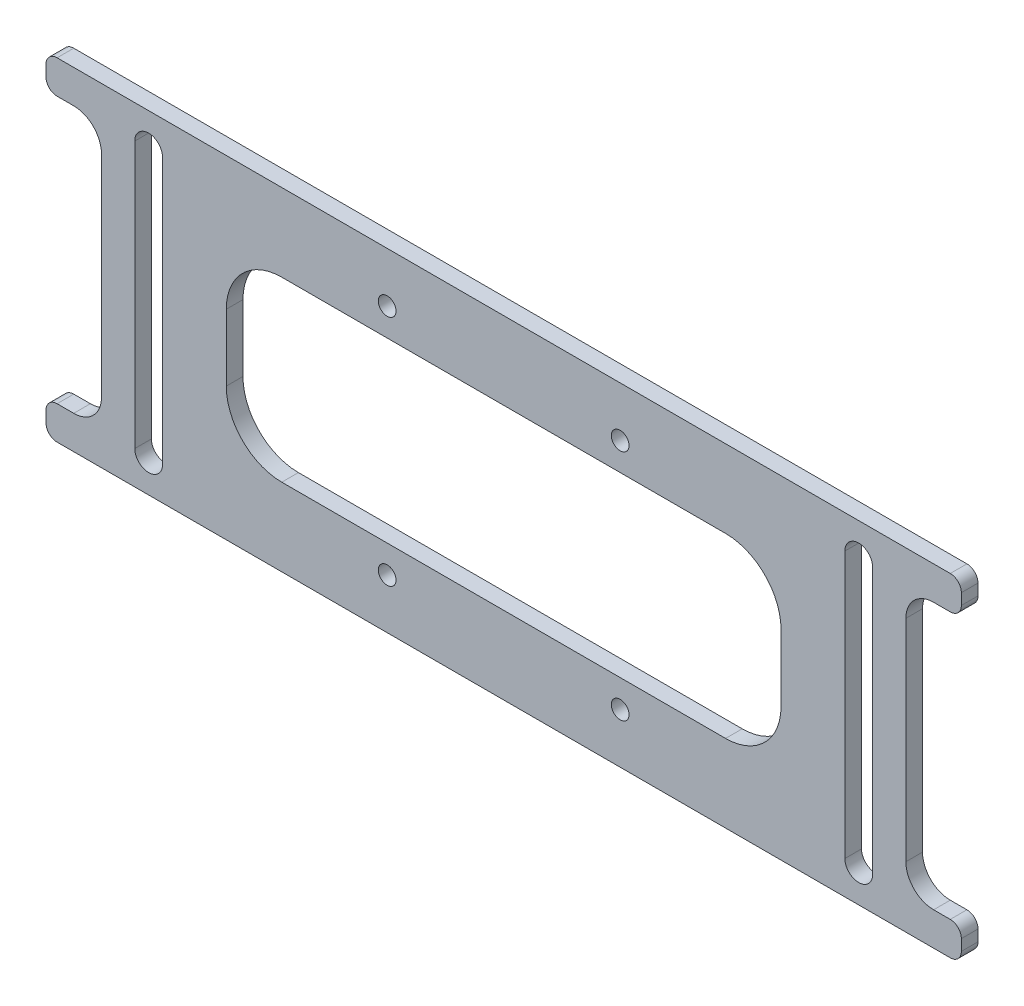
ISO-10303-21;
HEADER;
FILE_DESCRIPTION(('STEP AP214'),'2;1');
FILE_NAME('part.step','',(''),(''),'','','');
FILE_SCHEMA(('AUTOMOTIVE_DESIGN { 1 0 10303 214 1 1 1 1 }'));
ENDSEC;
DATA;
#1=APPLICATION_CONTEXT('core data for automotive mechanical design processes');
#2=APPLICATION_PROTOCOL_DEFINITION('international standard','automotive_design',2000,#1);
#3=PRODUCT_CONTEXT('',#1,'mechanical');
#4=PRODUCT('Part','Part','',(#3));
#5=PRODUCT_RELATED_PRODUCT_CATEGORY('part','',(#4));
#6=PRODUCT_DEFINITION_FORMATION('','',#4);
#7=PRODUCT_DEFINITION_CONTEXT('part definition',#1,'design');
#8=PRODUCT_DEFINITION('design','',#6,#7);
#9=PRODUCT_DEFINITION_SHAPE('','',#8);
#10=(LENGTH_UNIT() NAMED_UNIT(*) SI_UNIT(.MILLI.,.METRE.));
#11=(NAMED_UNIT(*) PLANE_ANGLE_UNIT() SI_UNIT($,.RADIAN.));
#12=(NAMED_UNIT(*) SI_UNIT($,.STERADIAN.) SOLID_ANGLE_UNIT());
#13=UNCERTAINTY_MEASURE_WITH_UNIT(LENGTH_MEASURE(1.E-05),#10,'distance_accuracy_value','');
#14=(GEOMETRIC_REPRESENTATION_CONTEXT(3) GLOBAL_UNCERTAINTY_ASSIGNED_CONTEXT((#13)) GLOBAL_UNIT_ASSIGNED_CONTEXT((#10,
#11,#12)) REPRESENTATION_CONTEXT('',''));
#15=CARTESIAN_POINT('',(0.,0.,0.));
#16=DIRECTION('',(0.,0.,1.));
#17=DIRECTION('',(1.,0.,0.));
#18=AXIS2_PLACEMENT_3D('',#15,#16,#17);
#19=CARTESIAN_POINT('',(82.4999999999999,30.,3.));
#20=DIRECTION('',(-1.,0.,0.));
#21=DIRECTION('',(0.,0.,1.));
#22=AXIS2_PLACEMENT_3D('',#19,#20,#21);
#23=PLANE('',#22);
#24=DIRECTION('',(0.,1.,0.));
#25=VECTOR('',#24,1.);
#26=CARTESIAN_POINT('',(82.4999999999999,30.,3.));
#27=LINE('',#26,#25);
#28=CARTESIAN_POINT('',(82.4999999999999,26.,3.));
#29=VERTEX_POINT('',#28);
#30=CARTESIAN_POINT('',(82.4999999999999,28.,3.));
#31=VERTEX_POINT('',#30);
#32=EDGE_CURVE('E407',#29,#31,#27,.T.);
#33=ORIENTED_EDGE('',*,*,#32,.F.);
#34=DIRECTION('',(0.,0.,1.));
#35=VECTOR('',#34,1.);
#36=CARTESIAN_POINT('',(82.4999999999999,26.,3.));
#37=LINE('',#36,#35);
#38=CARTESIAN_POINT('',(82.4999999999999,26.,0.));
#39=VERTEX_POINT('',#38);
#40=EDGE_CURVE('E523',#29,#39,#37,.F.);
#41=ORIENTED_EDGE('',*,*,#40,.T.);
#42=DIRECTION('',(0.,1.,0.));
#43=VECTOR('',#42,1.);
#44=CARTESIAN_POINT('',(82.4999999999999,30.,0.));
#45=LINE('',#44,#43);
#46=CARTESIAN_POINT('',(82.4999999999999,28.,0.));
#47=VERTEX_POINT('',#46);
#48=EDGE_CURVE('E406',#39,#47,#45,.T.);
#49=ORIENTED_EDGE('',*,*,#48,.T.);
#50=DIRECTION('',(0.,0.,-1.));
#51=VECTOR('',#50,1.);
#52=CARTESIAN_POINT('',(82.4999999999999,28.,3.));
#53=LINE('',#52,#51);
#54=EDGE_CURVE('E521',#47,#31,#53,.F.);
#55=ORIENTED_EDGE('',*,*,#54,.T.);
#56=EDGE_LOOP('',(#33,#41,#49,#55));
#57=FACE_BOUND('',#56,.T.);
#58=ADVANCED_FACE('F34',(#57),#23,.F.);
#59=CARTESIAN_POINT('',(-82.5000000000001,30.,3.));
#60=DIRECTION('',(1.,0.,0.));
#61=DIRECTION('',(0.,0.,-1.));
#62=AXIS2_PLACEMENT_3D('',#59,#60,#61);
#63=PLANE('',#62);
#64=DIRECTION('',(0.,-1.,0.));
#65=VECTOR('',#64,1.);
#66=CARTESIAN_POINT('',(-82.5000000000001,30.,0.));
#67=LINE('',#66,#65);
#68=CARTESIAN_POINT('',(-82.5000000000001,-26.,0.));
#69=VERTEX_POINT('',#68);
#70=CARTESIAN_POINT('',(-82.5000000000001,-28.,0.));
#71=VERTEX_POINT('',#70);
#72=EDGE_CURVE('E429',#69,#71,#67,.T.);
#73=ORIENTED_EDGE('',*,*,#72,.T.);
#74=DIRECTION('',(0.,0.,-1.));
#75=VECTOR('',#74,1.);
#76=CARTESIAN_POINT('',(-82.5000000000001,-28.,3.));
#77=LINE('',#76,#75);
#78=CARTESIAN_POINT('',(-82.5000000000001,-28.,3.));
#79=VERTEX_POINT('',#78);
#80=EDGE_CURVE('E532',#71,#79,#77,.F.);
#81=ORIENTED_EDGE('',*,*,#80,.T.);
#82=DIRECTION('',(0.,-1.,0.));
#83=VECTOR('',#82,1.);
#84=CARTESIAN_POINT('',(-82.5000000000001,30.,3.));
#85=LINE('',#84,#83);
#86=CARTESIAN_POINT('',(-82.5000000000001,-26.,3.));
#87=VERTEX_POINT('',#86);
#88=EDGE_CURVE('E415',#87,#79,#85,.T.);
#89=ORIENTED_EDGE('',*,*,#88,.F.);
#90=DIRECTION('',(0.,0.,1.));
#91=VECTOR('',#90,1.);
#92=CARTESIAN_POINT('',(-82.5000000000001,-26.,0.));
#93=LINE('',#92,#91);
#94=EDGE_CURVE('E530',#87,#69,#93,.F.);
#95=ORIENTED_EDGE('',*,*,#94,.T.);
#96=EDGE_LOOP('',(#73,#81,#89,#95));
#97=FACE_BOUND('',#96,.T.);
#98=ADVANCED_FACE('F700',(#97),#63,.F.);
#99=CARTESIAN_POINT('',(-82.5000000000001,28.,0.));
#100=VERTEX_POINT('',#99);
#101=CARTESIAN_POINT('',(-82.5000000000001,26.,0.));
#102=VERTEX_POINT('',#101);
#103=EDGE_CURVE('E430',#100,#102,#67,.T.);
#104=ORIENTED_EDGE('',*,*,#103,.T.);
#105=DIRECTION('',(0.,0.,1.));
#106=VECTOR('',#105,1.);
#107=CARTESIAN_POINT('',(-82.5000000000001,26.,3.));
#108=LINE('',#107,#106);
#109=CARTESIAN_POINT('',(-82.5000000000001,26.,3.));
#110=VERTEX_POINT('',#109);
#111=EDGE_CURVE('E540',#102,#110,#108,.T.);
#112=ORIENTED_EDGE('',*,*,#111,.T.);
#113=CARTESIAN_POINT('',(-82.5000000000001,28.,3.));
#114=VERTEX_POINT('',#113);
#115=EDGE_CURVE('E418',#114,#110,#85,.T.);
#116=ORIENTED_EDGE('',*,*,#115,.F.);
#117=DIRECTION('',(0.,0.,-1.));
#118=VECTOR('',#117,1.);
#119=CARTESIAN_POINT('',(-82.5000000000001,28.,3.));
#120=LINE('',#119,#118);
#121=EDGE_CURVE('E537',#114,#100,#120,.T.);
#122=ORIENTED_EDGE('',*,*,#121,.T.);
#123=EDGE_LOOP('',(#104,#112,#116,#122));
#124=FACE_BOUND('',#123,.T.);
#125=ADVANCED_FACE('F594',(#124),#63,.F.);
#126=CARTESIAN_POINT('',(0.,0.,3.));
#127=DIRECTION('',(0.,0.,1.));
#128=DIRECTION('',(1.,0.,0.));
#129=AXIS2_PLACEMENT_3D('',#126,#127,#128);
#130=PLANE('',#129);
#131=DIRECTION('',(0.,1.,0.));
#132=VECTOR('',#131,1.);
#133=CARTESIAN_POINT('',(50.,-16.,3.));
#134=LINE('',#133,#132);
#135=CARTESIAN_POINT('',(50.,-6.,3.));
#136=VERTEX_POINT('',#135);
#137=CARTESIAN_POINT('',(50.,5.99999999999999,3.));
#138=VERTEX_POINT('',#137);
#139=EDGE_CURVE('E1125',#136,#138,#134,.T.);
#140=ORIENTED_EDGE('',*,*,#139,.F.);
#141=CARTESIAN_POINT('',(40.,-6.,3.));
#142=DIRECTION('',(0.,0.,1.));
#143=DIRECTION('',(1.,0.,0.));
#144=AXIS2_PLACEMENT_3D('',#141,#142,#143);
#145=CIRCLE('',#144,10.);
#146=CARTESIAN_POINT('',(40.,-16.,3.));
#147=VERTEX_POINT('',#146);
#148=EDGE_CURVE('E454',#136,#147,#145,.F.);
#149=ORIENTED_EDGE('',*,*,#148,.T.);
#150=DIRECTION('',(1.,0.,0.));
#151=VECTOR('',#150,1.);
#152=CARTESIAN_POINT('',(-50.,-16.,3.));
#153=LINE('',#152,#151);
#154=CARTESIAN_POINT('',(-40.,-16.,3.));
#155=VERTEX_POINT('',#154);
#156=EDGE_CURVE('E1115',#155,#147,#153,.T.);
#157=ORIENTED_EDGE('',*,*,#156,.F.);
#158=CARTESIAN_POINT('',(-40.,-6.,3.));
#159=DIRECTION('',(0.,0.,1.));
#160=DIRECTION('',(1.,0.,0.));
#161=AXIS2_PLACEMENT_3D('',#158,#159,#160);
#162=CIRCLE('',#161,10.);
#163=CARTESIAN_POINT('',(-50.,-6.,3.));
#164=VERTEX_POINT('',#163);
#165=EDGE_CURVE('E458',#155,#164,#162,.F.);
#166=ORIENTED_EDGE('',*,*,#165,.T.);
#167=DIRECTION('',(0.,-1.,0.));
#168=VECTOR('',#167,1.);
#169=CARTESIAN_POINT('',(-50.,-16.,3.));
#170=LINE('',#169,#168);
#171=CARTESIAN_POINT('',(-50.,5.99999999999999,3.));
#172=VERTEX_POINT('',#171);
#173=EDGE_CURVE('E1119',#172,#164,#170,.T.);
#174=ORIENTED_EDGE('',*,*,#173,.F.);
#175=CARTESIAN_POINT('',(-40.,5.99999999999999,3.));
#176=DIRECTION('',(0.,0.,1.));
#177=DIRECTION('',(1.,0.,0.));
#178=AXIS2_PLACEMENT_3D('',#175,#176,#177);
#179=CIRCLE('',#178,10.);
#180=CARTESIAN_POINT('',(-40.,16.,3.));
#181=VERTEX_POINT('',#180);
#182=EDGE_CURVE('E466',#172,#181,#179,.F.);
#183=ORIENTED_EDGE('',*,*,#182,.T.);
#184=DIRECTION('',(-1.,0.,0.));
#185=VECTOR('',#184,1.);
#186=CARTESIAN_POINT('',(-50.,16.,3.));
#187=LINE('',#186,#185);
#188=CARTESIAN_POINT('',(40.,16.,3.));
#189=VERTEX_POINT('',#188);
#190=EDGE_CURVE('E1122',#189,#181,#187,.T.);
#191=ORIENTED_EDGE('',*,*,#190,.F.);
#192=CARTESIAN_POINT('',(40.,6.,3.));
#193=DIRECTION('',(0.,0.,1.));
#194=DIRECTION('',(1.,0.,0.));
#195=AXIS2_PLACEMENT_3D('',#192,#193,#194);
#196=CIRCLE('',#195,10.);
#197=EDGE_CURVE('E462',#189,#138,#196,.F.);
#198=ORIENTED_EDGE('',*,*,#197,.T.);
#199=EDGE_LOOP('',(#140,#149,#157,#166,#174,#183,#191,#198));
#200=FACE_BOUND('',#199,.T.);
#201=DIRECTION('',(1.,0.,0.));
#202=VECTOR('',#201,1.);
#203=CARTESIAN_POINT('',(-82.5000000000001,-30.,3.));
#204=LINE('',#203,#202);
#205=CARTESIAN_POINT('',(-80.5000000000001,-30.,3.));
#206=VERTEX_POINT('',#205);
#207=CARTESIAN_POINT('',(80.4999999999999,-30.,3.));
#208=VERTEX_POINT('',#207);
#209=EDGE_CURVE('E419',#206,#208,#204,.T.);
#210=ORIENTED_EDGE('',*,*,#209,.T.);
#211=CARTESIAN_POINT('',(80.4999999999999,-28.,3.));
#212=DIRECTION('',(0.,0.,1.));
#213=DIRECTION('',(1.,0.,0.));
#214=AXIS2_PLACEMENT_3D('',#211,#212,#213);
#215=CIRCLE('',#214,2.);
#216=CARTESIAN_POINT('',(82.4999999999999,-28.,3.));
#217=VERTEX_POINT('',#216);
#218=EDGE_CURVE('E513',#208,#217,#215,.T.);
#219=ORIENTED_EDGE('',*,*,#218,.T.);
#220=CARTESIAN_POINT('',(82.4999999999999,-26.,3.));
#221=VERTEX_POINT('',#220);
#222=EDGE_CURVE('E410',#217,#221,#27,.T.);
#223=ORIENTED_EDGE('',*,*,#222,.T.);
#224=CARTESIAN_POINT('',(80.4999999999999,-26.,3.));
#225=DIRECTION('',(0.,0.,1.));
#226=DIRECTION('',(1.,0.,0.));
#227=AXIS2_PLACEMENT_3D('',#224,#225,#226);
#228=CIRCLE('',#227,2.);
#229=CARTESIAN_POINT('',(80.4999999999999,-24.,3.));
#230=VERTEX_POINT('',#229);
#231=EDGE_CURVE('E510',#221,#230,#228,.T.);
#232=ORIENTED_EDGE('',*,*,#231,.T.);
#233=DIRECTION('',(1.,0.,0.));
#234=VECTOR('',#233,1.);
#235=CARTESIAN_POINT('',(0.,-24.,3.));
#236=LINE('',#235,#234);
#237=CARTESIAN_POINT('',(77.5,-24.,3.));
#238=VERTEX_POINT('',#237);
#239=EDGE_CURVE('E638',#238,#230,#236,.T.);
#240=ORIENTED_EDGE('',*,*,#239,.F.);
#241=CARTESIAN_POINT('',(77.5,-19.,3.));
#242=DIRECTION('',(0.,0.,1.));
#243=DIRECTION('',(1.,0.,0.));
#244=AXIS2_PLACEMENT_3D('',#241,#242,#243);
#245=CIRCLE('',#244,5.);
#246=CARTESIAN_POINT('',(72.5,-19.,3.));
#247=VERTEX_POINT('',#246);
#248=EDGE_CURVE('E564',#238,#247,#245,.F.);
#249=ORIENTED_EDGE('',*,*,#248,.T.);
#250=DIRECTION('',(0.,-1.,0.));
#251=VECTOR('',#250,1.);
#252=CARTESIAN_POINT('',(72.5,0.,3.));
#253=LINE('',#252,#251);
#254=CARTESIAN_POINT('',(72.5,19.,3.));
#255=VERTEX_POINT('',#254);
#256=EDGE_CURVE('E378',#255,#247,#253,.T.);
#257=ORIENTED_EDGE('',*,*,#256,.F.);
#258=CARTESIAN_POINT('',(77.5,19.,3.));
#259=DIRECTION('',(0.,0.,1.));
#260=DIRECTION('',(1.,0.,0.));
#261=AXIS2_PLACEMENT_3D('',#258,#259,#260);
#262=CIRCLE('',#261,5.);
#263=CARTESIAN_POINT('',(77.5,24.,3.));
#264=VERTEX_POINT('',#263);
#265=EDGE_CURVE('E568',#255,#264,#262,.F.);
#266=ORIENTED_EDGE('',*,*,#265,.T.);
#267=DIRECTION('',(-1.,0.,0.));
#268=VECTOR('',#267,1.);
#269=CARTESIAN_POINT('',(0.,24.0000000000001,3.));
#270=LINE('',#269,#268);
#271=CARTESIAN_POINT('',(80.4999999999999,24.,3.));
#272=VERTEX_POINT('',#271);
#273=EDGE_CURVE('E624',#272,#264,#270,.T.);
#274=ORIENTED_EDGE('',*,*,#273,.F.);
#275=CARTESIAN_POINT('',(80.4999999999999,26.,3.));
#276=DIRECTION('',(0.,0.,1.));
#277=DIRECTION('',(1.,0.,0.));
#278=AXIS2_PLACEMENT_3D('',#275,#276,#277);
#279=CIRCLE('',#278,2.);
#280=EDGE_CURVE('E508',#272,#29,#279,.T.);
#281=ORIENTED_EDGE('',*,*,#280,.T.);
#282=ORIENTED_EDGE('',*,*,#32,.T.);
#283=CARTESIAN_POINT('',(80.4999999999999,28.,3.));
#284=DIRECTION('',(0.,0.,1.));
#285=DIRECTION('',(1.,0.,0.));
#286=AXIS2_PLACEMENT_3D('',#283,#284,#285);
#287=CIRCLE('',#286,2.);
#288=CARTESIAN_POINT('',(80.4999999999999,30.,3.));
#289=VERTEX_POINT('',#288);
#290=EDGE_CURVE('E506',#31,#289,#287,.T.);
#291=ORIENTED_EDGE('',*,*,#290,.T.);
#292=DIRECTION('',(-1.,0.,0.));
#293=VECTOR('',#292,1.);
#294=CARTESIAN_POINT('',(-82.5000000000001,30.,3.));
#295=LINE('',#294,#293);
#296=CARTESIAN_POINT('',(-80.5000000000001,30.,3.));
#297=VERTEX_POINT('',#296);
#298=EDGE_CURVE('E412',#289,#297,#295,.T.);
#299=ORIENTED_EDGE('',*,*,#298,.T.);
#300=CARTESIAN_POINT('',(-80.5000000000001,28.,3.));
#301=DIRECTION('',(0.,0.,1.));
#302=DIRECTION('',(1.,0.,0.));
#303=AXIS2_PLACEMENT_3D('',#300,#301,#302);
#304=CIRCLE('',#303,2.);
#305=EDGE_CURVE('E498',#297,#114,#304,.T.);
#306=ORIENTED_EDGE('',*,*,#305,.T.);
#307=ORIENTED_EDGE('',*,*,#115,.T.);
#308=CARTESIAN_POINT('',(-80.5000000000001,26.,3.));
#309=DIRECTION('',(0.,0.,1.));
#310=DIRECTION('',(1.,0.,0.));
#311=AXIS2_PLACEMENT_3D('',#308,#309,#310);
#312=CIRCLE('',#311,2.);
#313=CARTESIAN_POINT('',(-80.5000000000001,24.,3.));
#314=VERTEX_POINT('',#313);
#315=EDGE_CURVE('E500',#110,#314,#312,.T.);
#316=ORIENTED_EDGE('',*,*,#315,.T.);
#317=DIRECTION('',(1.,0.,0.));
#318=VECTOR('',#317,1.);
#319=CARTESIAN_POINT('',(0.,24.,3.));
#320=LINE('',#319,#318);
#321=CARTESIAN_POINT('',(-77.5000000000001,24.,3.));
#322=VERTEX_POINT('',#321);
#323=EDGE_CURVE('E369',#314,#322,#320,.T.);
#324=ORIENTED_EDGE('',*,*,#323,.T.);
#325=CARTESIAN_POINT('',(-77.5000000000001,19.,3.));
#326=DIRECTION('',(0.,0.,1.));
#327=DIRECTION('',(1.,0.,0.));
#328=AXIS2_PLACEMENT_3D('',#325,#326,#327);
#329=CIRCLE('',#328,5.);
#330=CARTESIAN_POINT('',(-72.5000000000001,19.,3.));
#331=VERTEX_POINT('',#330);
#332=EDGE_CURVE('E42',#322,#331,#329,.F.);
#333=ORIENTED_EDGE('',*,*,#332,.T.);
#334=DIRECTION('',(0.,-1.,0.));
#335=VECTOR('',#334,1.);
#336=CARTESIAN_POINT('',(-72.5000000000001,0.,3.));
#337=LINE('',#336,#335);
#338=CARTESIAN_POINT('',(-72.5000000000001,-19.,3.));
#339=VERTEX_POINT('',#338);
#340=EDGE_CURVE('E377',#331,#339,#337,.T.);
#341=ORIENTED_EDGE('',*,*,#340,.T.);
#342=CARTESIAN_POINT('',(-77.5000000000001,-19.,3.));
#343=DIRECTION('',(0.,0.,1.));
#344=DIRECTION('',(1.,0.,0.));
#345=AXIS2_PLACEMENT_3D('',#342,#343,#344);
#346=CIRCLE('',#345,5.);
#347=CARTESIAN_POINT('',(-77.5000000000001,-24.,3.));
#348=VERTEX_POINT('',#347);
#349=EDGE_CURVE('E572',#339,#348,#346,.F.);
#350=ORIENTED_EDGE('',*,*,#349,.T.);
#351=DIRECTION('',(-1.,0.,0.));
#352=VECTOR('',#351,1.);
#353=CARTESIAN_POINT('',(0.,-24.,3.));
#354=LINE('',#353,#352);
#355=CARTESIAN_POINT('',(-80.5000000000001,-24.,3.));
#356=VERTEX_POINT('',#355);
#357=EDGE_CURVE('E375',#348,#356,#354,.T.);
#358=ORIENTED_EDGE('',*,*,#357,.T.);
#359=CARTESIAN_POINT('',(-80.5000000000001,-26.,3.));
#360=DIRECTION('',(0.,0.,1.));
#361=DIRECTION('',(1.,0.,0.));
#362=AXIS2_PLACEMENT_3D('',#359,#360,#361);
#363=CIRCLE('',#362,2.);
#364=EDGE_CURVE('E502',#356,#87,#363,.T.);
#365=ORIENTED_EDGE('',*,*,#364,.T.);
#366=ORIENTED_EDGE('',*,*,#88,.T.);
#367=CARTESIAN_POINT('',(-80.5000000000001,-28.,3.));
#368=DIRECTION('',(0.,0.,1.));
#369=DIRECTION('',(1.,0.,0.));
#370=AXIS2_PLACEMENT_3D('',#367,#368,#369);
#371=CIRCLE('',#370,2.);
#372=EDGE_CURVE('E504',#79,#206,#371,.T.);
#373=ORIENTED_EDGE('',*,*,#372,.T.);
#374=EDGE_LOOP('',(#210,#219,#223,#232,#240,#249,#257,#266,#274,#281,#282,#291,#299,#306,#307,
#316,#324,#333,#341,#350,#358,#365,#366,#373));
#375=FACE_BOUND('',#374,.T.);
#376=CARTESIAN_POINT('',(-64.0000000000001,24.,3.));
#377=DIRECTION('',(0.,0.,1.));
#378=DIRECTION('',(1.,0.,0.));
#379=AXIS2_PLACEMENT_3D('',#376,#377,#378);
#380=CIRCLE('',#379,2.5);
#381=CARTESIAN_POINT('',(-61.5000000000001,24.,3.));
#382=VERTEX_POINT('',#381);
#383=CARTESIAN_POINT('',(-66.5000000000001,24.,3.));
#384=VERTEX_POINT('',#383);
#385=EDGE_CURVE('E294',#382,#384,#380,.T.);
#386=ORIENTED_EDGE('',*,*,#385,.F.);
#387=DIRECTION('',(0.,-1.,0.));
#388=VECTOR('',#387,1.);
#389=CARTESIAN_POINT('',(-61.5000000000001,24.,3.));
#390=LINE('',#389,#388);
#391=CARTESIAN_POINT('',(-61.5000000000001,-24.,3.));
#392=VERTEX_POINT('',#391);
#393=EDGE_CURVE('E304',#382,#392,#390,.T.);
#394=ORIENTED_EDGE('',*,*,#393,.T.);
#395=CARTESIAN_POINT('',(-64.,-24.,3.));
#396=DIRECTION('',(0.,0.,1.));
#397=DIRECTION('',(1.,0.,0.));
#398=AXIS2_PLACEMENT_3D('',#395,#396,#397);
#399=CIRCLE('',#398,2.5);
#400=CARTESIAN_POINT('',(-66.5,-24.,3.));
#401=VERTEX_POINT('',#400);
#402=EDGE_CURVE('E310',#401,#392,#399,.T.);
#403=ORIENTED_EDGE('',*,*,#402,.F.);
#404=DIRECTION('',(0.,-1.,0.));
#405=VECTOR('',#404,1.);
#406=CARTESIAN_POINT('',(-66.5000000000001,24.,3.));
#407=LINE('',#406,#405);
#408=EDGE_CURVE('E316',#384,#401,#407,.T.);
#409=ORIENTED_EDGE('',*,*,#408,.F.);
#410=EDGE_LOOP('',(#386,#394,#403,#409));
#411=FACE_BOUND('',#410,.T.);
#412=CARTESIAN_POINT('',(63.9999999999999,24.,3.));
#413=DIRECTION('',(0.,0.,1.));
#414=DIRECTION('',(1.,0.,0.));
#415=AXIS2_PLACEMENT_3D('',#412,#413,#414);
#416=CIRCLE('',#415,2.5);
#417=CARTESIAN_POINT('',(66.4999999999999,24.,3.));
#418=VERTEX_POINT('',#417);
#419=CARTESIAN_POINT('',(61.4999999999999,24.,3.));
#420=VERTEX_POINT('',#419);
#421=EDGE_CURVE('E301',#418,#420,#416,.T.);
#422=ORIENTED_EDGE('',*,*,#421,.F.);
#423=DIRECTION('',(0.,-1.,0.));
#424=VECTOR('',#423,1.);
#425=CARTESIAN_POINT('',(66.4999999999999,24.,3.));
#426=LINE('',#425,#424);
#427=CARTESIAN_POINT('',(66.4999999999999,-24.,3.));
#428=VERTEX_POINT('',#427);
#429=EDGE_CURVE('E346',#418,#428,#426,.T.);
#430=ORIENTED_EDGE('',*,*,#429,.T.);
#431=CARTESIAN_POINT('',(64.,-24.,3.));
#432=DIRECTION('',(0.,0.,1.));
#433=DIRECTION('',(1.,0.,0.));
#434=AXIS2_PLACEMENT_3D('',#431,#432,#433);
#435=CIRCLE('',#434,2.5);
#436=CARTESIAN_POINT('',(61.5,-24.,3.));
#437=VERTEX_POINT('',#436);
#438=EDGE_CURVE('E349',#437,#428,#435,.T.);
#439=ORIENTED_EDGE('',*,*,#438,.F.);
#440=DIRECTION('',(0.,-1.,0.));
#441=VECTOR('',#440,1.);
#442=CARTESIAN_POINT('',(61.4999999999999,24.,3.));
#443=LINE('',#442,#441);
#444=EDGE_CURVE('E353',#420,#437,#443,.T.);
#445=ORIENTED_EDGE('',*,*,#444,.F.);
#446=EDGE_LOOP('',(#422,#430,#439,#445));
#447=FACE_BOUND('',#446,.T.);
#448=CARTESIAN_POINT('',(-21.,21.,3.));
#449=DIRECTION('',(0.,0.,1.));
#450=DIRECTION('',(1.,0.,0.));
#451=AXIS2_PLACEMENT_3D('',#448,#449,#450);
#452=CIRCLE('',#451,1.6);
#453=CARTESIAN_POINT('',(-19.4,21.,3.));
#454=VERTEX_POINT('',#453);
#455=EDGE_CURVE('E374',#454,#454,#452,.T.);
#456=ORIENTED_EDGE('',*,*,#455,.F.);
#457=EDGE_LOOP('',(#456));
#458=FACE_BOUND('',#457,.T.);
#459=CARTESIAN_POINT('',(-21.,-21.,3.));
#460=DIRECTION('',(0.,0.,1.));
#461=DIRECTION('',(1.,0.,0.));
#462=AXIS2_PLACEMENT_3D('',#459,#460,#461);
#463=CIRCLE('',#462,1.6);
#464=CARTESIAN_POINT('',(-19.4,-21.,3.));
#465=VERTEX_POINT('',#464);
#466=EDGE_CURVE('E388',#465,#465,#463,.T.);
#467=ORIENTED_EDGE('',*,*,#466,.F.);
#468=EDGE_LOOP('',(#467));
#469=FACE_BOUND('',#468,.T.);
#470=CARTESIAN_POINT('',(21.,21.,3.));
#471=DIRECTION('',(0.,0.,1.));
#472=DIRECTION('',(1.,0.,0.));
#473=AXIS2_PLACEMENT_3D('',#470,#471,#472);
#474=CIRCLE('',#473,1.6);
#475=CARTESIAN_POINT('',(22.6,21.,3.));
#476=VERTEX_POINT('',#475);
#477=EDGE_CURVE('E394',#476,#476,#474,.T.);
#478=ORIENTED_EDGE('',*,*,#477,.F.);
#479=EDGE_LOOP('',(#478));
#480=FACE_BOUND('',#479,.T.);
#481=CARTESIAN_POINT('',(21.,-21.,3.));
#482=DIRECTION('',(0.,0.,1.));
#483=DIRECTION('',(1.,0.,0.));
#484=AXIS2_PLACEMENT_3D('',#481,#482,#483);
#485=CIRCLE('',#484,1.6);
#486=CARTESIAN_POINT('',(22.6,-21.,3.));
#487=VERTEX_POINT('',#486);
#488=EDGE_CURVE('E400',#487,#487,#485,.T.);
#489=ORIENTED_EDGE('',*,*,#488,.F.);
#490=EDGE_LOOP('',(#489));
#491=FACE_BOUND('',#490,.T.);
#492=ADVANCED_FACE('F313',(#200,#375,#411,#447,#458,#469,#480,#491),#130,.T.);
#493=CARTESIAN_POINT('',(0.,0.,0.));
#494=DIRECTION('',(0.,0.,1.));
#495=DIRECTION('',(1.,0.,0.));
#496=AXIS2_PLACEMENT_3D('',#493,#494,#495);
#497=PLANE('',#496);
#498=DIRECTION('',(0.,-1.,0.));
#499=VECTOR('',#498,1.);
#500=CARTESIAN_POINT('',(-50.,-16.,0.));
#501=LINE('',#500,#499);
#502=CARTESIAN_POINT('',(-50.,5.99999999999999,0.));
#503=VERTEX_POINT('',#502);
#504=CARTESIAN_POINT('',(-50.,-6.,0.));
#505=VERTEX_POINT('',#504);
#506=EDGE_CURVE('E1130',#503,#505,#501,.T.);
#507=ORIENTED_EDGE('',*,*,#506,.T.);
#508=CARTESIAN_POINT('',(-40.,-6.,0.));
#509=DIRECTION('',(0.,0.,1.));
#510=DIRECTION('',(1.,0.,0.));
#511=AXIS2_PLACEMENT_3D('',#508,#509,#510);
#512=CIRCLE('',#511,10.);
#513=CARTESIAN_POINT('',(-40.,-16.,0.));
#514=VERTEX_POINT('',#513);
#515=EDGE_CURVE('E460',#505,#514,#512,.T.);
#516=ORIENTED_EDGE('',*,*,#515,.T.);
#517=DIRECTION('',(1.,0.,0.));
#518=VECTOR('',#517,1.);
#519=CARTESIAN_POINT('',(-50.,-16.,0.));
#520=LINE('',#519,#518);
#521=CARTESIAN_POINT('',(40.,-16.,0.));
#522=VERTEX_POINT('',#521);
#523=EDGE_CURVE('E345',#514,#522,#520,.T.);
#524=ORIENTED_EDGE('',*,*,#523,.T.);
#525=CARTESIAN_POINT('',(40.,-6.,0.));
#526=DIRECTION('',(0.,0.,1.));
#527=DIRECTION('',(1.,0.,0.));
#528=AXIS2_PLACEMENT_3D('',#525,#526,#527);
#529=CIRCLE('',#528,10.);
#530=CARTESIAN_POINT('',(50.,-6.,0.));
#531=VERTEX_POINT('',#530);
#532=EDGE_CURVE('E456',#522,#531,#529,.T.);
#533=ORIENTED_EDGE('',*,*,#532,.T.);
#534=DIRECTION('',(0.,1.,0.));
#535=VECTOR('',#534,1.);
#536=CARTESIAN_POINT('',(50.,-16.,0.));
#537=LINE('',#536,#535);
#538=CARTESIAN_POINT('',(50.,5.99999999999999,0.));
#539=VERTEX_POINT('',#538);
#540=EDGE_CURVE('E1118',#531,#539,#537,.T.);
#541=ORIENTED_EDGE('',*,*,#540,.T.);
#542=CARTESIAN_POINT('',(40.,6.,0.));
#543=DIRECTION('',(0.,0.,1.));
#544=DIRECTION('',(1.,0.,0.));
#545=AXIS2_PLACEMENT_3D('',#542,#543,#544);
#546=CIRCLE('',#545,10.);
#547=CARTESIAN_POINT('',(40.,16.,0.));
#548=VERTEX_POINT('',#547);
#549=EDGE_CURVE('E464',#539,#548,#546,.T.);
#550=ORIENTED_EDGE('',*,*,#549,.T.);
#551=DIRECTION('',(-1.,0.,0.));
#552=VECTOR('',#551,1.);
#553=CARTESIAN_POINT('',(-50.,16.,0.));
#554=LINE('',#553,#552);
#555=CARTESIAN_POINT('',(-40.,16.,0.));
#556=VERTEX_POINT('',#555);
#557=EDGE_CURVE('E1133',#548,#556,#554,.T.);
#558=ORIENTED_EDGE('',*,*,#557,.T.);
#559=CARTESIAN_POINT('',(-40.,5.99999999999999,0.));
#560=DIRECTION('',(0.,0.,1.));
#561=DIRECTION('',(1.,0.,0.));
#562=AXIS2_PLACEMENT_3D('',#559,#560,#561);
#563=CIRCLE('',#562,10.);
#564=EDGE_CURVE('E468',#556,#503,#563,.T.);
#565=ORIENTED_EDGE('',*,*,#564,.T.);
#566=EDGE_LOOP('',(#507,#516,#524,#533,#541,#550,#558,#565));
#567=FACE_BOUND('',#566,.T.);
#568=DIRECTION('',(0.,-1.,0.));
#569=VECTOR('',#568,1.);
#570=CARTESIAN_POINT('',(-61.5000000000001,24.,0.));
#571=LINE('',#570,#569);
#572=CARTESIAN_POINT('',(-61.5000000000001,24.,0.));
#573=VERTEX_POINT('',#572);
#574=CARTESIAN_POINT('',(-61.5000000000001,-24.,0.));
#575=VERTEX_POINT('',#574);
#576=EDGE_CURVE('E325',#573,#575,#571,.T.);
#577=ORIENTED_EDGE('',*,*,#576,.F.);
#578=CARTESIAN_POINT('',(-64.0000000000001,24.,0.));
#579=DIRECTION('',(0.,0.,1.));
#580=DIRECTION('',(1.,0.,0.));
#581=AXIS2_PLACEMENT_3D('',#578,#579,#580);
#582=CIRCLE('',#581,2.5);
#583=CARTESIAN_POINT('',(-66.5000000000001,24.,0.));
#584=VERTEX_POINT('',#583);
#585=EDGE_CURVE('E297',#573,#584,#582,.T.);
#586=ORIENTED_EDGE('',*,*,#585,.T.);
#587=DIRECTION('',(0.,-1.,0.));
#588=VECTOR('',#587,1.);
#589=CARTESIAN_POINT('',(-66.5000000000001,24.,0.));
#590=LINE('',#589,#588);
#591=CARTESIAN_POINT('',(-66.5,-24.,0.));
#592=VERTEX_POINT('',#591);
#593=EDGE_CURVE('E331',#584,#592,#590,.T.);
#594=ORIENTED_EDGE('',*,*,#593,.T.);
#595=CARTESIAN_POINT('',(-64.,-24.,0.));
#596=DIRECTION('',(0.,0.,1.));
#597=DIRECTION('',(1.,0.,0.));
#598=AXIS2_PLACEMENT_3D('',#595,#596,#597);
#599=CIRCLE('',#598,2.5);
#600=EDGE_CURVE('E327',#592,#575,#599,.T.);
#601=ORIENTED_EDGE('',*,*,#600,.T.);
#602=EDGE_LOOP('',(#577,#586,#594,#601));
#603=FACE_BOUND('',#602,.T.);
#604=DIRECTION('',(0.,-1.,0.));
#605=VECTOR('',#604,1.);
#606=CARTESIAN_POINT('',(66.4999999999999,24.,0.));
#607=LINE('',#606,#605);
#608=CARTESIAN_POINT('',(66.4999999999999,24.,0.));
#609=VERTEX_POINT('',#608);
#610=CARTESIAN_POINT('',(66.4999999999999,-24.,0.));
#611=VERTEX_POINT('',#610);
#612=EDGE_CURVE('E338',#609,#611,#607,.T.);
#613=ORIENTED_EDGE('',*,*,#612,.F.);
#614=CARTESIAN_POINT('',(63.9999999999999,24.,0.));
#615=DIRECTION('',(0.,0.,1.));
#616=DIRECTION('',(1.,0.,0.));
#617=AXIS2_PLACEMENT_3D('',#614,#615,#616);
#618=CIRCLE('',#617,2.5);
#619=CARTESIAN_POINT('',(61.4999999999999,24.,0.));
#620=VERTEX_POINT('',#619);
#621=EDGE_CURVE('E350',#609,#620,#618,.T.);
#622=ORIENTED_EDGE('',*,*,#621,.T.);
#623=DIRECTION('',(0.,-1.,0.));
#624=VECTOR('',#623,1.);
#625=CARTESIAN_POINT('',(61.4999999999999,24.,0.));
#626=LINE('',#625,#624);
#627=CARTESIAN_POINT('',(61.5,-24.,0.));
#628=VERTEX_POINT('',#627);
#629=EDGE_CURVE('E361',#620,#628,#626,.T.);
#630=ORIENTED_EDGE('',*,*,#629,.T.);
#631=CARTESIAN_POINT('',(64.,-24.,0.));
#632=DIRECTION('',(0.,0.,1.));
#633=DIRECTION('',(1.,0.,0.));
#634=AXIS2_PLACEMENT_3D('',#631,#632,#633);
#635=CIRCLE('',#634,2.5);
#636=EDGE_CURVE('E358',#628,#611,#635,.T.);
#637=ORIENTED_EDGE('',*,*,#636,.T.);
#638=EDGE_LOOP('',(#613,#622,#630,#637));
#639=FACE_BOUND('',#638,.T.);
#640=CARTESIAN_POINT('',(21.,-21.,0.));
#641=DIRECTION('',(0.,0.,1.));
#642=DIRECTION('',(1.,0.,0.));
#643=AXIS2_PLACEMENT_3D('',#640,#641,#642);
#644=CIRCLE('',#643,1.6);
#645=CARTESIAN_POINT('',(22.6,-21.,0.));
#646=VERTEX_POINT('',#645);
#647=EDGE_CURVE('E403',#646,#646,#644,.T.);
#648=ORIENTED_EDGE('',*,*,#647,.T.);
#649=EDGE_LOOP('',(#648));
#650=FACE_BOUND('',#649,.T.);
#651=CARTESIAN_POINT('',(21.,21.,0.));
#652=DIRECTION('',(0.,0.,1.));
#653=DIRECTION('',(1.,0.,0.));
#654=AXIS2_PLACEMENT_3D('',#651,#652,#653);
#655=CIRCLE('',#654,1.6);
#656=CARTESIAN_POINT('',(22.6,21.,0.));
#657=VERTEX_POINT('',#656);
#658=EDGE_CURVE('E397',#657,#657,#655,.T.);
#659=ORIENTED_EDGE('',*,*,#658,.T.);
#660=EDGE_LOOP('',(#659));
#661=FACE_BOUND('',#660,.T.);
#662=CARTESIAN_POINT('',(-21.,-21.,0.));
#663=DIRECTION('',(0.,0.,1.));
#664=DIRECTION('',(1.,0.,0.));
#665=AXIS2_PLACEMENT_3D('',#662,#663,#664);
#666=CIRCLE('',#665,1.6);
#667=CARTESIAN_POINT('',(-19.4,-21.,0.));
#668=VERTEX_POINT('',#667);
#669=EDGE_CURVE('E391',#668,#668,#666,.T.);
#670=ORIENTED_EDGE('',*,*,#669,.T.);
#671=EDGE_LOOP('',(#670));
#672=FACE_BOUND('',#671,.T.);
#673=CARTESIAN_POINT('',(-21.,21.,0.));
#674=DIRECTION('',(0.,0.,1.));
#675=DIRECTION('',(1.,0.,0.));
#676=AXIS2_PLACEMENT_3D('',#673,#674,#675);
#677=CIRCLE('',#676,1.6);
#678=CARTESIAN_POINT('',(-19.4,21.,0.));
#679=VERTEX_POINT('',#678);
#680=EDGE_CURVE('E385',#679,#679,#677,.T.);
#681=ORIENTED_EDGE('',*,*,#680,.T.);
#682=EDGE_LOOP('',(#681));
#683=FACE_BOUND('',#682,.T.);
#684=CARTESIAN_POINT('',(82.4999999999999,-28.,0.));
#685=VERTEX_POINT('',#684);
#686=CARTESIAN_POINT('',(82.4999999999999,-26.,0.));
#687=VERTEX_POINT('',#686);
#688=EDGE_CURVE('E425',#685,#687,#45,.T.);
#689=ORIENTED_EDGE('',*,*,#688,.F.);
#690=CARTESIAN_POINT('',(80.4999999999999,-28.,0.));
#691=DIRECTION('',(0.,0.,1.));
#692=DIRECTION('',(1.,0.,0.));
#693=AXIS2_PLACEMENT_3D('',#690,#691,#692);
#694=CIRCLE('',#693,2.);
#695=CARTESIAN_POINT('',(80.4999999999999,-30.,0.));
#696=VERTEX_POINT('',#695);
#697=EDGE_CURVE('E491',#685,#696,#694,.F.);
#698=ORIENTED_EDGE('',*,*,#697,.T.);
#699=DIRECTION('',(1.,0.,0.));
#700=VECTOR('',#699,1.);
#701=CARTESIAN_POINT('',(-82.5000000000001,-30.,0.));
#702=LINE('',#701,#700);
#703=CARTESIAN_POINT('',(-80.5000000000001,-30.,0.));
#704=VERTEX_POINT('',#703);
#705=EDGE_CURVE('E411',#704,#696,#702,.T.);
#706=ORIENTED_EDGE('',*,*,#705,.F.);
#707=CARTESIAN_POINT('',(-80.5000000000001,-28.,0.));
#708=DIRECTION('',(0.,0.,1.));
#709=DIRECTION('',(1.,0.,0.));
#710=AXIS2_PLACEMENT_3D('',#707,#708,#709);
#711=CIRCLE('',#710,2.);
#712=EDGE_CURVE('E483',#704,#71,#711,.F.);
#713=ORIENTED_EDGE('',*,*,#712,.T.);
#714=ORIENTED_EDGE('',*,*,#72,.F.);
#715=CARTESIAN_POINT('',(-80.5000000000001,-26.,0.));
#716=DIRECTION('',(0.,0.,1.));
#717=DIRECTION('',(1.,0.,0.));
#718=AXIS2_PLACEMENT_3D('',#715,#716,#717);
#719=CIRCLE('',#718,2.);
#720=CARTESIAN_POINT('',(-80.5000000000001,-24.,0.));
#721=VERTEX_POINT('',#720);
#722=EDGE_CURVE('E480',#69,#721,#719,.F.);
#723=ORIENTED_EDGE('',*,*,#722,.T.);
#724=DIRECTION('',(-1.,0.,0.));
#725=VECTOR('',#724,1.);
#726=CARTESIAN_POINT('',(0.,-24.,0.));
#727=LINE('',#726,#725);
#728=CARTESIAN_POINT('',(-77.5000000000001,-24.,0.));
#729=VERTEX_POINT('',#728);
#730=EDGE_CURVE('E366',#729,#721,#727,.T.);
#731=ORIENTED_EDGE('',*,*,#730,.F.);
#732=CARTESIAN_POINT('',(-77.5000000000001,-19.,0.));
#733=DIRECTION('',(0.,0.,1.));
#734=DIRECTION('',(1.,0.,0.));
#735=AXIS2_PLACEMENT_3D('',#732,#733,#734);
#736=CIRCLE('',#735,5.);
#737=CARTESIAN_POINT('',(-72.5000000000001,-19.,0.));
#738=VERTEX_POINT('',#737);
#739=EDGE_CURVE('E574',#729,#738,#736,.T.);
#740=ORIENTED_EDGE('',*,*,#739,.T.);
#741=DIRECTION('',(0.,-1.,0.));
#742=VECTOR('',#741,1.);
#743=CARTESIAN_POINT('',(-72.5000000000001,0.,0.));
#744=LINE('',#743,#742);
#745=CARTESIAN_POINT('',(-72.5000000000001,19.,0.));
#746=VERTEX_POINT('',#745);
#747=EDGE_CURVE('E368',#746,#738,#744,.T.);
#748=ORIENTED_EDGE('',*,*,#747,.F.);
#749=CARTESIAN_POINT('',(-77.5000000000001,19.,0.));
#750=DIRECTION('',(0.,0.,1.));
#751=DIRECTION('',(1.,0.,0.));
#752=AXIS2_PLACEMENT_3D('',#749,#750,#751);
#753=CIRCLE('',#752,5.);
#754=CARTESIAN_POINT('',(-77.5000000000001,24.,0.));
#755=VERTEX_POINT('',#754);
#756=EDGE_CURVE('E11',#746,#755,#753,.T.);
#757=ORIENTED_EDGE('',*,*,#756,.T.);
#758=DIRECTION('',(1.,0.,0.));
#759=VECTOR('',#758,1.);
#760=CARTESIAN_POINT('',(0.,24.,0.));
#761=LINE('',#760,#759);
#762=CARTESIAN_POINT('',(-80.5000000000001,24.,0.));
#763=VERTEX_POINT('',#762);
#764=EDGE_CURVE('E372',#763,#755,#761,.T.);
#765=ORIENTED_EDGE('',*,*,#764,.F.);
#766=CARTESIAN_POINT('',(-80.5000000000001,26.,0.));
#767=DIRECTION('',(0.,0.,1.));
#768=DIRECTION('',(1.,0.,0.));
#769=AXIS2_PLACEMENT_3D('',#766,#767,#768);
#770=CIRCLE('',#769,2.);
#771=EDGE_CURVE('E478',#763,#102,#770,.F.);
#772=ORIENTED_EDGE('',*,*,#771,.T.);
#773=ORIENTED_EDGE('',*,*,#103,.F.);
#774=CARTESIAN_POINT('',(-80.5000000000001,28.,0.));
#775=DIRECTION('',(0.,0.,1.));
#776=DIRECTION('',(1.,0.,0.));
#777=AXIS2_PLACEMENT_3D('',#774,#775,#776);
#778=CIRCLE('',#777,2.);
#779=CARTESIAN_POINT('',(-80.5000000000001,30.,0.));
#780=VERTEX_POINT('',#779);
#781=EDGE_CURVE('E476',#100,#780,#778,.F.);
#782=ORIENTED_EDGE('',*,*,#781,.T.);
#783=DIRECTION('',(-1.,0.,0.));
#784=VECTOR('',#783,1.);
#785=CARTESIAN_POINT('',(-82.5000000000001,30.,0.));
#786=LINE('',#785,#784);
#787=CARTESIAN_POINT('',(80.4999999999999,30.,0.));
#788=VERTEX_POINT('',#787);
#789=EDGE_CURVE('E426',#788,#780,#786,.T.);
#790=ORIENTED_EDGE('',*,*,#789,.F.);
#791=CARTESIAN_POINT('',(80.4999999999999,28.,0.));
#792=DIRECTION('',(0.,0.,1.));
#793=DIRECTION('',(1.,0.,0.));
#794=AXIS2_PLACEMENT_3D('',#791,#792,#793);
#795=CIRCLE('',#794,2.);
#796=EDGE_CURVE('E485',#788,#47,#795,.F.);
#797=ORIENTED_EDGE('',*,*,#796,.T.);
#798=ORIENTED_EDGE('',*,*,#48,.F.);
#799=CARTESIAN_POINT('',(80.4999999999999,26.,0.));
#800=DIRECTION('',(0.,0.,1.));
#801=DIRECTION('',(1.,0.,0.));
#802=AXIS2_PLACEMENT_3D('',#799,#800,#801);
#803=CIRCLE('',#802,2.);
#804=CARTESIAN_POINT('',(80.4999999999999,24.,0.));
#805=VERTEX_POINT('',#804);
#806=EDGE_CURVE('E487',#39,#805,#803,.F.);
#807=ORIENTED_EDGE('',*,*,#806,.T.);
#808=DIRECTION('',(-1.,0.,0.));
#809=VECTOR('',#808,1.);
#810=CARTESIAN_POINT('',(0.,24.0000000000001,0.));
#811=LINE('',#810,#809);
#812=CARTESIAN_POINT('',(77.5,24.,0.));
#813=VERTEX_POINT('',#812);
#814=EDGE_CURVE('E317',#805,#813,#811,.T.);
#815=ORIENTED_EDGE('',*,*,#814,.T.);
#816=CARTESIAN_POINT('',(77.5,19.,0.));
#817=DIRECTION('',(0.,0.,1.));
#818=DIRECTION('',(1.,0.,0.));
#819=AXIS2_PLACEMENT_3D('',#816,#817,#818);
#820=CIRCLE('',#819,5.);
#821=CARTESIAN_POINT('',(72.5,19.,0.));
#822=VERTEX_POINT('',#821);
#823=EDGE_CURVE('E570',#813,#822,#820,.T.);
#824=ORIENTED_EDGE('',*,*,#823,.T.);
#825=DIRECTION('',(0.,-1.,0.));
#826=VECTOR('',#825,1.);
#827=CARTESIAN_POINT('',(72.5,0.,0.));
#828=LINE('',#827,#826);
#829=CARTESIAN_POINT('',(72.5,-19.,0.));
#830=VERTEX_POINT('',#829);
#831=EDGE_CURVE('E630',#822,#830,#828,.T.);
#832=ORIENTED_EDGE('',*,*,#831,.T.);
#833=CARTESIAN_POINT('',(77.5,-19.,0.));
#834=DIRECTION('',(0.,0.,1.));
#835=DIRECTION('',(1.,0.,0.));
#836=AXIS2_PLACEMENT_3D('',#833,#834,#835);
#837=CIRCLE('',#836,5.);
#838=CARTESIAN_POINT('',(77.5,-24.,0.));
#839=VERTEX_POINT('',#838);
#840=EDGE_CURVE('E566',#830,#839,#837,.T.);
#841=ORIENTED_EDGE('',*,*,#840,.T.);
#842=DIRECTION('',(1.,0.,0.));
#843=VECTOR('',#842,1.);
#844=CARTESIAN_POINT('',(0.,-24.,0.));
#845=LINE('',#844,#843);
#846=CARTESIAN_POINT('',(80.4999999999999,-24.,0.));
#847=VERTEX_POINT('',#846);
#848=EDGE_CURVE('E320',#839,#847,#845,.T.);
#849=ORIENTED_EDGE('',*,*,#848,.T.);
#850=CARTESIAN_POINT('',(80.4999999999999,-26.,0.));
#851=DIRECTION('',(0.,0.,1.));
#852=DIRECTION('',(1.,0.,0.));
#853=AXIS2_PLACEMENT_3D('',#850,#851,#852);
#854=CIRCLE('',#853,2.);
#855=EDGE_CURVE('E489',#847,#687,#854,.F.);
#856=ORIENTED_EDGE('',*,*,#855,.T.);
#857=EDGE_LOOP('',(#689,#698,#706,#713,#714,#723,#731,#740,#748,#757,#765,#772,#773,#782,#790,
#797,#798,#807,#815,#824,#832,#841,#849,#856));
#858=FACE_BOUND('',#857,.T.);
#859=ADVANCED_FACE('F586',(#567,#603,#639,#650,#661,#672,#683,#858),#497,.F.);
#860=ORIENTED_EDGE('',*,*,#222,.F.);
#861=DIRECTION('',(0.,0.,-1.));
#862=VECTOR('',#861,1.);
#863=CARTESIAN_POINT('',(82.4999999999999,-28.,3.));
#864=LINE('',#863,#862);
#865=EDGE_CURVE('E473',#217,#685,#864,.T.);
#866=ORIENTED_EDGE('',*,*,#865,.T.);
#867=ORIENTED_EDGE('',*,*,#688,.T.);
#868=DIRECTION('',(0.,0.,1.));
#869=VECTOR('',#868,1.);
#870=CARTESIAN_POINT('',(82.4999999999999,-26.,3.));
#871=LINE('',#870,#869);
#872=EDGE_CURVE('E470',#687,#221,#871,.T.);
#873=ORIENTED_EDGE('',*,*,#872,.T.);
#874=EDGE_LOOP('',(#860,#866,#867,#873));
#875=FACE_BOUND('',#874,.T.);
#876=ADVANCED_FACE('F654',(#875),#23,.F.);
#877=CARTESIAN_POINT('',(-82.5000000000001,30.,3.));
#878=DIRECTION('',(0.,-1.,0.));
#879=DIRECTION('',(0.,0.,-1.));
#880=AXIS2_PLACEMENT_3D('',#877,#878,#879);
#881=PLANE('',#880);
#882=ORIENTED_EDGE('',*,*,#298,.F.);
#883=DIRECTION('',(0.,0.,-1.));
#884=VECTOR('',#883,1.);
#885=CARTESIAN_POINT('',(80.4999999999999,30.,3.));
#886=LINE('',#885,#884);
#887=EDGE_CURVE('E527',#289,#788,#886,.T.);
#888=ORIENTED_EDGE('',*,*,#887,.T.);
#889=ORIENTED_EDGE('',*,*,#789,.T.);
#890=DIRECTION('',(0.,0.,-1.));
#891=VECTOR('',#890,1.);
#892=CARTESIAN_POINT('',(-80.5000000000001,30.,3.));
#893=LINE('',#892,#891);
#894=EDGE_CURVE('E525',#780,#297,#893,.F.);
#895=ORIENTED_EDGE('',*,*,#894,.T.);
#896=EDGE_LOOP('',(#882,#888,#889,#895));
#897=FACE_BOUND('',#896,.T.);
#898=ADVANCED_FACE('F603',(#897),#881,.F.);
#899=CARTESIAN_POINT('',(-82.5000000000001,-30.,3.));
#900=DIRECTION('',(0.,1.,0.));
#901=DIRECTION('',(0.,0.,1.));
#902=AXIS2_PLACEMENT_3D('',#899,#900,#901);
#903=PLANE('',#902);
#904=ORIENTED_EDGE('',*,*,#705,.T.);
#905=DIRECTION('',(0.,0.,-1.));
#906=VECTOR('',#905,1.);
#907=CARTESIAN_POINT('',(80.4999999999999,-30.,3.));
#908=LINE('',#907,#906);
#909=EDGE_CURVE('E496',#696,#208,#908,.F.);
#910=ORIENTED_EDGE('',*,*,#909,.T.);
#911=ORIENTED_EDGE('',*,*,#209,.F.);
#912=DIRECTION('',(0.,0.,-1.));
#913=VECTOR('',#912,1.);
#914=CARTESIAN_POINT('',(-80.5000000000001,-30.,3.));
#915=LINE('',#914,#913);
#916=EDGE_CURVE('E493',#206,#704,#915,.T.);
#917=ORIENTED_EDGE('',*,*,#916,.T.);
#918=EDGE_LOOP('',(#904,#910,#911,#917));
#919=FACE_BOUND('',#918,.T.);
#920=ADVANCED_FACE('F688',(#919),#903,.F.);
#921=CARTESIAN_POINT('',(21.,-21.,3.));
#922=DIRECTION('',(0.,0.,1.));
#923=DIRECTION('',(1.,0.,0.));
#924=AXIS2_PLACEMENT_3D('',#921,#922,#923);
#925=CYLINDRICAL_SURFACE('',#924,1.6);
#926=ORIENTED_EDGE('',*,*,#647,.F.);
#927=EDGE_LOOP('',(#926));
#928=FACE_BOUND('',#927,.T.);
#929=ORIENTED_EDGE('',*,*,#488,.T.);
#930=EDGE_LOOP('',(#929));
#931=FACE_BOUND('',#930,.T.);
#932=ADVANCED_FACE('F685',(#928,#931),#925,.F.);
#933=CARTESIAN_POINT('',(21.,21.,3.));
#934=DIRECTION('',(0.,0.,1.));
#935=DIRECTION('',(1.,0.,0.));
#936=AXIS2_PLACEMENT_3D('',#933,#934,#935);
#937=CYLINDRICAL_SURFACE('',#936,1.6);
#938=ORIENTED_EDGE('',*,*,#658,.F.);
#939=EDGE_LOOP('',(#938));
#940=FACE_BOUND('',#939,.T.);
#941=ORIENTED_EDGE('',*,*,#477,.T.);
#942=EDGE_LOOP('',(#941));
#943=FACE_BOUND('',#942,.T.);
#944=ADVANCED_FACE('F687',(#940,#943),#937,.F.);
#945=CARTESIAN_POINT('',(-21.,-21.,3.));
#946=DIRECTION('',(0.,0.,1.));
#947=DIRECTION('',(1.,0.,0.));
#948=AXIS2_PLACEMENT_3D('',#945,#946,#947);
#949=CYLINDRICAL_SURFACE('',#948,1.6);
#950=ORIENTED_EDGE('',*,*,#669,.F.);
#951=EDGE_LOOP('',(#950));
#952=FACE_BOUND('',#951,.T.);
#953=ORIENTED_EDGE('',*,*,#466,.T.);
#954=EDGE_LOOP('',(#953));
#955=FACE_BOUND('',#954,.T.);
#956=ADVANCED_FACE('F671',(#952,#955),#949,.F.);
#957=CARTESIAN_POINT('',(-21.,21.,3.));
#958=DIRECTION('',(0.,0.,1.));
#959=DIRECTION('',(1.,0.,0.));
#960=AXIS2_PLACEMENT_3D('',#957,#958,#959);
#961=CYLINDRICAL_SURFACE('',#960,1.6);
#962=ORIENTED_EDGE('',*,*,#680,.F.);
#963=EDGE_LOOP('',(#962));
#964=FACE_BOUND('',#963,.T.);
#965=ORIENTED_EDGE('',*,*,#455,.T.);
#966=EDGE_LOOP('',(#965));
#967=FACE_BOUND('',#966,.T.);
#968=ADVANCED_FACE('F667',(#964,#967),#961,.F.);
#969=CARTESIAN_POINT('',(0.,-24.,0.));
#970=DIRECTION('',(0.,1.,0.));
#971=DIRECTION('',(-1.,0.,0.));
#972=AXIS2_PLACEMENT_3D('',#969,#970,#971);
#973=PLANE('',#972);
#974=ORIENTED_EDGE('',*,*,#357,.F.);
#975=DIRECTION('',(0.,0.,1.));
#976=VECTOR('',#975,1.);
#977=CARTESIAN_POINT('',(-77.5000000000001,-24.,0.));
#978=LINE('',#977,#976);
#979=EDGE_CURVE('E560',#348,#729,#978,.F.);
#980=ORIENTED_EDGE('',*,*,#979,.T.);
#981=ORIENTED_EDGE('',*,*,#730,.T.);
#982=DIRECTION('',(0.,0.,1.));
#983=VECTOR('',#982,1.);
#984=CARTESIAN_POINT('',(-80.5000000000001,-24.,3.));
#985=LINE('',#984,#983);
#986=EDGE_CURVE('E534',#721,#356,#985,.T.);
#987=ORIENTED_EDGE('',*,*,#986,.T.);
#988=EDGE_LOOP('',(#974,#980,#981,#987));
#989=FACE_BOUND('',#988,.T.);
#990=ADVANCED_FACE('F670',(#989),#973,.T.);
#991=CARTESIAN_POINT('',(0.,24.,0.));
#992=DIRECTION('',(0.,-1.,0.));
#993=DIRECTION('',(0.,0.,-1.));
#994=AXIS2_PLACEMENT_3D('',#991,#992,#993);
#995=PLANE('',#994);
#996=ORIENTED_EDGE('',*,*,#764,.T.);
#997=DIRECTION('',(0.,0.,1.));
#998=VECTOR('',#997,1.);
#999=CARTESIAN_POINT('',(-77.5000000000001,24.,3.));
#1000=LINE('',#999,#998);
#1001=EDGE_CURVE('E562',#755,#322,#1000,.T.);
#1002=ORIENTED_EDGE('',*,*,#1001,.T.);
#1003=ORIENTED_EDGE('',*,*,#323,.F.);
#1004=DIRECTION('',(0.,0.,1.));
#1005=VECTOR('',#1004,1.);
#1006=CARTESIAN_POINT('',(-80.5000000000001,24.,0.));
#1007=LINE('',#1006,#1005);
#1008=EDGE_CURVE('E543',#314,#763,#1007,.F.);
#1009=ORIENTED_EDGE('',*,*,#1008,.T.);
#1010=EDGE_LOOP('',(#996,#1002,#1003,#1009));
#1011=FACE_BOUND('',#1010,.T.);
#1012=ADVANCED_FACE('F582',(#1011),#995,.T.);
#1013=CARTESIAN_POINT('',(-72.5000000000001,0.,0.));
#1014=DIRECTION('',(-1.,0.,0.));
#1015=DIRECTION('',(0.,0.,1.));
#1016=AXIS2_PLACEMENT_3D('',#1013,#1014,#1015);
#1017=PLANE('',#1016);
#1018=ORIENTED_EDGE('',*,*,#747,.T.);
#1019=DIRECTION('',(0.,0.,1.));
#1020=VECTOR('',#1019,1.);
#1021=CARTESIAN_POINT('',(-72.5000000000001,-19.,3.));
#1022=LINE('',#1021,#1020);
#1023=EDGE_CURVE('E557',#738,#339,#1022,.T.);
#1024=ORIENTED_EDGE('',*,*,#1023,.T.);
#1025=ORIENTED_EDGE('',*,*,#340,.F.);
#1026=DIRECTION('',(0.,0.,1.));
#1027=VECTOR('',#1026,1.);
#1028=CARTESIAN_POINT('',(-72.5000000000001,19.,0.));
#1029=LINE('',#1028,#1027);
#1030=EDGE_CURVE('E555',#331,#746,#1029,.F.);
#1031=ORIENTED_EDGE('',*,*,#1030,.T.);
#1032=EDGE_LOOP('',(#1018,#1024,#1025,#1031));
#1033=FACE_BOUND('',#1032,.T.);
#1034=ADVANCED_FACE('F579',(#1033),#1017,.T.);
#1035=CARTESIAN_POINT('',(72.5,0.,0.));
#1036=DIRECTION('',(-1.,0.,0.));
#1037=DIRECTION('',(0.,0.,1.));
#1038=AXIS2_PLACEMENT_3D('',#1035,#1036,#1037);
#1039=PLANE('',#1038);
#1040=ORIENTED_EDGE('',*,*,#256,.T.);
#1041=DIRECTION('',(0.,0.,1.));
#1042=VECTOR('',#1041,1.);
#1043=CARTESIAN_POINT('',(72.5,-19.,0.));
#1044=LINE('',#1043,#1042);
#1045=EDGE_CURVE('E551',#247,#830,#1044,.F.);
#1046=ORIENTED_EDGE('',*,*,#1045,.T.);
#1047=ORIENTED_EDGE('',*,*,#831,.F.);
#1048=DIRECTION('',(0.,0.,1.));
#1049=VECTOR('',#1048,1.);
#1050=CARTESIAN_POINT('',(72.5,19.,3.));
#1051=LINE('',#1050,#1049);
#1052=EDGE_CURVE('E548',#822,#255,#1051,.T.);
#1053=ORIENTED_EDGE('',*,*,#1052,.T.);
#1054=EDGE_LOOP('',(#1040,#1046,#1047,#1053));
#1055=FACE_BOUND('',#1054,.T.);
#1056=ADVANCED_FACE('F634',(#1055),#1039,.F.);
#1057=CARTESIAN_POINT('',(0.,24.0000000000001,0.));
#1058=DIRECTION('',(0.,1.,0.));
#1059=DIRECTION('',(-1.,0.,0.));
#1060=AXIS2_PLACEMENT_3D('',#1057,#1058,#1059);
#1061=PLANE('',#1060);
#1062=ORIENTED_EDGE('',*,*,#273,.T.);
#1063=DIRECTION('',(0.,0.,1.));
#1064=VECTOR('',#1063,1.);
#1065=CARTESIAN_POINT('',(77.5,24.,0.));
#1066=LINE('',#1065,#1064);
#1067=EDGE_CURVE('E553',#264,#813,#1066,.F.);
#1068=ORIENTED_EDGE('',*,*,#1067,.T.);
#1069=ORIENTED_EDGE('',*,*,#814,.F.);
#1070=DIRECTION('',(0.,0.,1.));
#1071=VECTOR('',#1070,1.);
#1072=CARTESIAN_POINT('',(80.4999999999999,24.,0.));
#1073=LINE('',#1072,#1071);
#1074=EDGE_CURVE('E518',#805,#272,#1073,.T.);
#1075=ORIENTED_EDGE('',*,*,#1074,.T.);
#1076=EDGE_LOOP('',(#1062,#1068,#1069,#1075));
#1077=FACE_BOUND('',#1076,.T.);
#1078=ADVANCED_FACE('F621',(#1077),#1061,.F.);
#1079=CARTESIAN_POINT('',(0.,-24.,0.));
#1080=DIRECTION('',(0.,-1.,0.));
#1081=DIRECTION('',(0.,0.,-1.));
#1082=AXIS2_PLACEMENT_3D('',#1079,#1080,#1081);
#1083=PLANE('',#1082);
#1084=ORIENTED_EDGE('',*,*,#848,.F.);
#1085=DIRECTION('',(0.,0.,1.));
#1086=VECTOR('',#1085,1.);
#1087=CARTESIAN_POINT('',(77.5,-24.,3.));
#1088=LINE('',#1087,#1086);
#1089=EDGE_CURVE('E545',#839,#238,#1088,.T.);
#1090=ORIENTED_EDGE('',*,*,#1089,.T.);
#1091=ORIENTED_EDGE('',*,*,#239,.T.);
#1092=DIRECTION('',(0.,0.,1.));
#1093=VECTOR('',#1092,1.);
#1094=CARTESIAN_POINT('',(80.4999999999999,-24.,0.));
#1095=LINE('',#1094,#1093);
#1096=EDGE_CURVE('E515',#230,#847,#1095,.F.);
#1097=ORIENTED_EDGE('',*,*,#1096,.T.);
#1098=EDGE_LOOP('',(#1084,#1090,#1091,#1097));
#1099=FACE_BOUND('',#1098,.T.);
#1100=ADVANCED_FACE('F777',(#1099),#1083,.F.);
#1101=CARTESIAN_POINT('',(63.9999999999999,24.,0.));
#1102=DIRECTION('',(0.,0.,1.));
#1103=DIRECTION('',(1.,0.,0.));
#1104=AXIS2_PLACEMENT_3D('',#1101,#1102,#1103);
#1105=CYLINDRICAL_SURFACE('',#1104,2.5);
#1106=ORIENTED_EDGE('',*,*,#421,.T.);
#1107=DIRECTION('',(0.,0.,1.));
#1108=VECTOR('',#1107,1.);
#1109=CARTESIAN_POINT('',(61.4999999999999,24.,0.));
#1110=LINE('',#1109,#1108);
#1111=EDGE_CURVE('E335',#620,#420,#1110,.T.);
#1112=ORIENTED_EDGE('',*,*,#1111,.F.);
#1113=ORIENTED_EDGE('',*,*,#621,.F.);
#1114=DIRECTION('',(0.,0.,1.));
#1115=VECTOR('',#1114,1.);
#1116=CARTESIAN_POINT('',(66.4999999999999,24.,0.));
#1117=LINE('',#1116,#1115);
#1118=EDGE_CURVE('E343',#609,#418,#1117,.T.);
#1119=ORIENTED_EDGE('',*,*,#1118,.T.);
#1120=EDGE_LOOP('',(#1106,#1112,#1113,#1119));
#1121=FACE_BOUND('',#1120,.T.);
#1122=ADVANCED_FACE('F771',(#1121),#1105,.F.);
#1123=CARTESIAN_POINT('',(66.4999999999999,24.,0.));
#1124=DIRECTION('',(-1.,0.,0.));
#1125=DIRECTION('',(0.,0.,1.));
#1126=AXIS2_PLACEMENT_3D('',#1123,#1124,#1125);
#1127=PLANE('',#1126);
#1128=ORIENTED_EDGE('',*,*,#429,.F.);
#1129=ORIENTED_EDGE('',*,*,#1118,.F.);
#1130=ORIENTED_EDGE('',*,*,#612,.T.);
#1131=DIRECTION('',(0.,0.,1.));
#1132=VECTOR('',#1131,1.);
#1133=CARTESIAN_POINT('',(66.4999999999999,-24.,0.));
#1134=LINE('',#1133,#1132);
#1135=EDGE_CURVE('E341',#611,#428,#1134,.T.);
#1136=ORIENTED_EDGE('',*,*,#1135,.T.);
#1137=EDGE_LOOP('',(#1128,#1129,#1130,#1136));
#1138=FACE_BOUND('',#1137,.T.);
#1139=ADVANCED_FACE('F776',(#1138),#1127,.T.);
#1140=CARTESIAN_POINT('',(64.,-24.,0.));
#1141=DIRECTION('',(0.,0.,1.));
#1142=DIRECTION('',(1.,0.,0.));
#1143=AXIS2_PLACEMENT_3D('',#1140,#1141,#1142);
#1144=CYLINDRICAL_SURFACE('',#1143,2.5);
#1145=ORIENTED_EDGE('',*,*,#438,.T.);
#1146=ORIENTED_EDGE('',*,*,#1135,.F.);
#1147=ORIENTED_EDGE('',*,*,#636,.F.);
#1148=DIRECTION('',(0.,0.,1.));
#1149=VECTOR('',#1148,1.);
#1150=CARTESIAN_POINT('',(61.5,-24.,0.));
#1151=LINE('',#1150,#1149);
#1152=EDGE_CURVE('E339',#628,#437,#1151,.T.);
#1153=ORIENTED_EDGE('',*,*,#1152,.T.);
#1154=EDGE_LOOP('',(#1145,#1146,#1147,#1153));
#1155=FACE_BOUND('',#1154,.T.);
#1156=ADVANCED_FACE('F789',(#1155),#1144,.F.);
#1157=CARTESIAN_POINT('',(61.4999999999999,24.,0.));
#1158=DIRECTION('',(-1.,0.,0.));
#1159=DIRECTION('',(0.,-1.,0.));
#1160=AXIS2_PLACEMENT_3D('',#1157,#1158,#1159);
#1161=PLANE('',#1160);
#1162=ORIENTED_EDGE('',*,*,#444,.T.);
#1163=ORIENTED_EDGE('',*,*,#1152,.F.);
#1164=ORIENTED_EDGE('',*,*,#629,.F.);
#1165=ORIENTED_EDGE('',*,*,#1111,.T.);
#1166=EDGE_LOOP('',(#1162,#1163,#1164,#1165));
#1167=FACE_BOUND('',#1166,.T.);
#1168=ADVANCED_FACE('F799',(#1167),#1161,.F.);
#1169=CARTESIAN_POINT('',(-64.0000000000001,24.,0.));
#1170=DIRECTION('',(0.,0.,1.));
#1171=DIRECTION('',(1.,0.,0.));
#1172=AXIS2_PLACEMENT_3D('',#1169,#1170,#1171);
#1173=CYLINDRICAL_SURFACE('',#1172,2.5);
#1174=ORIENTED_EDGE('',*,*,#385,.T.);
#1175=DIRECTION('',(0.,0.,1.));
#1176=VECTOR('',#1175,1.);
#1177=CARTESIAN_POINT('',(-66.5000000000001,24.,0.));
#1178=LINE('',#1177,#1176);
#1179=EDGE_CURVE('E328',#584,#384,#1178,.T.);
#1180=ORIENTED_EDGE('',*,*,#1179,.F.);
#1181=ORIENTED_EDGE('',*,*,#585,.F.);
#1182=DIRECTION('',(0.,0.,1.));
#1183=VECTOR('',#1182,1.);
#1184=CARTESIAN_POINT('',(-61.5000000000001,24.,0.));
#1185=LINE('',#1184,#1183);
#1186=EDGE_CURVE('E290',#573,#382,#1185,.T.);
#1187=ORIENTED_EDGE('',*,*,#1186,.T.);
#1188=EDGE_LOOP('',(#1174,#1180,#1181,#1187));
#1189=FACE_BOUND('',#1188,.T.);
#1190=ADVANCED_FACE('F292',(#1189),#1173,.F.);
#1191=CARTESIAN_POINT('',(-61.5000000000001,24.,0.));
#1192=DIRECTION('',(-1.,0.,0.));
#1193=DIRECTION('',(0.,-1.,0.));
#1194=AXIS2_PLACEMENT_3D('',#1191,#1192,#1193);
#1195=PLANE('',#1194);
#1196=ORIENTED_EDGE('',*,*,#393,.F.);
#1197=ORIENTED_EDGE('',*,*,#1186,.F.);
#1198=ORIENTED_EDGE('',*,*,#576,.T.);
#1199=DIRECTION('',(0.,0.,1.));
#1200=VECTOR('',#1199,1.);
#1201=CARTESIAN_POINT('',(-61.5000000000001,-24.,0.));
#1202=LINE('',#1201,#1200);
#1203=EDGE_CURVE('E300',#575,#392,#1202,.T.);
#1204=ORIENTED_EDGE('',*,*,#1203,.T.);
#1205=EDGE_LOOP('',(#1196,#1197,#1198,#1204));
#1206=FACE_BOUND('',#1205,.T.);
#1207=ADVANCED_FACE('F305',(#1206),#1195,.T.);
#1208=CARTESIAN_POINT('',(-64.,-24.,0.));
#1209=DIRECTION('',(0.,0.,1.));
#1210=DIRECTION('',(1.,0.,0.));
#1211=AXIS2_PLACEMENT_3D('',#1208,#1209,#1210);
#1212=CYLINDRICAL_SURFACE('',#1211,2.5);
#1213=ORIENTED_EDGE('',*,*,#402,.T.);
#1214=ORIENTED_EDGE('',*,*,#1203,.F.);
#1215=ORIENTED_EDGE('',*,*,#600,.F.);
#1216=DIRECTION('',(0.,0.,1.));
#1217=VECTOR('',#1216,1.);
#1218=CARTESIAN_POINT('',(-66.5,-24.,0.));
#1219=LINE('',#1218,#1217);
#1220=EDGE_CURVE('E643',#592,#401,#1219,.T.);
#1221=ORIENTED_EDGE('',*,*,#1220,.T.);
#1222=EDGE_LOOP('',(#1213,#1214,#1215,#1221));
#1223=FACE_BOUND('',#1222,.T.);
#1224=ADVANCED_FACE('F646',(#1223),#1212,.F.);
#1225=CARTESIAN_POINT('',(-66.5000000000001,24.,0.));
#1226=DIRECTION('',(-1.,0.,0.));
#1227=DIRECTION('',(0.,-1.,0.));
#1228=AXIS2_PLACEMENT_3D('',#1225,#1226,#1227);
#1229=PLANE('',#1228);
#1230=ORIENTED_EDGE('',*,*,#408,.T.);
#1231=ORIENTED_EDGE('',*,*,#1220,.F.);
#1232=ORIENTED_EDGE('',*,*,#593,.F.);
#1233=ORIENTED_EDGE('',*,*,#1179,.T.);
#1234=EDGE_LOOP('',(#1230,#1231,#1232,#1233));
#1235=FACE_BOUND('',#1234,.T.);
#1236=ADVANCED_FACE('F650',(#1235),#1229,.F.);
#1237=CARTESIAN_POINT('',(50.,-16.,0.));
#1238=DIRECTION('',(1.,0.,0.));
#1239=DIRECTION('',(0.,0.,-1.));
#1240=AXIS2_PLACEMENT_3D('',#1237,#1238,#1239);
#1241=PLANE('',#1240);
#1242=ORIENTED_EDGE('',*,*,#540,.F.);
#1243=DIRECTION('',(0.,0.,1.));
#1244=VECTOR('',#1243,1.);
#1245=CARTESIAN_POINT('',(50.,-6.,3.));
#1246=LINE('',#1245,#1244);
#1247=EDGE_CURVE('E436',#531,#136,#1246,.T.);
#1248=ORIENTED_EDGE('',*,*,#1247,.T.);
#1249=ORIENTED_EDGE('',*,*,#139,.T.);
#1250=DIRECTION('',(0.,0.,1.));
#1251=VECTOR('',#1250,1.);
#1252=CARTESIAN_POINT('',(50.,6.,0.));
#1253=LINE('',#1252,#1251);
#1254=EDGE_CURVE('E422',#138,#539,#1253,.F.);
#1255=ORIENTED_EDGE('',*,*,#1254,.T.);
#1256=EDGE_LOOP('',(#1242,#1248,#1249,#1255));
#1257=FACE_BOUND('',#1256,.T.);
#1258=ADVANCED_FACE('F842',(#1257),#1241,.F.);
#1259=CARTESIAN_POINT('',(-50.,-16.,0.));
#1260=DIRECTION('',(0.,-1.,0.));
#1261=DIRECTION('',(0.,0.,-1.));
#1262=AXIS2_PLACEMENT_3D('',#1259,#1260,#1261);
#1263=PLANE('',#1262);
#1264=ORIENTED_EDGE('',*,*,#156,.T.);
#1265=DIRECTION('',(0.,0.,1.));
#1266=VECTOR('',#1265,1.);
#1267=CARTESIAN_POINT('',(40.,-16.,0.));
#1268=LINE('',#1267,#1266);
#1269=EDGE_CURVE('E442',#147,#522,#1268,.F.);
#1270=ORIENTED_EDGE('',*,*,#1269,.T.);
#1271=ORIENTED_EDGE('',*,*,#523,.F.);
#1272=DIRECTION('',(0.,0.,1.));
#1273=VECTOR('',#1272,1.);
#1274=CARTESIAN_POINT('',(-40.,-16.,3.));
#1275=LINE('',#1274,#1273);
#1276=EDGE_CURVE('E439',#514,#155,#1275,.T.);
#1277=ORIENTED_EDGE('',*,*,#1276,.T.);
#1278=EDGE_LOOP('',(#1264,#1270,#1271,#1277));
#1279=FACE_BOUND('',#1278,.T.);
#1280=ADVANCED_FACE('F851',(#1279),#1263,.F.);
#1281=CARTESIAN_POINT('',(-50.,-16.,0.));
#1282=DIRECTION('',(-1.,0.,0.));
#1283=DIRECTION('',(0.,0.,1.));
#1284=AXIS2_PLACEMENT_3D('',#1281,#1282,#1283);
#1285=PLANE('',#1284);
#1286=ORIENTED_EDGE('',*,*,#173,.T.);
#1287=DIRECTION('',(0.,0.,1.));
#1288=VECTOR('',#1287,1.);
#1289=CARTESIAN_POINT('',(-50.,-6.,0.));
#1290=LINE('',#1289,#1288);
#1291=EDGE_CURVE('E447',#164,#505,#1290,.F.);
#1292=ORIENTED_EDGE('',*,*,#1291,.T.);
#1293=ORIENTED_EDGE('',*,*,#506,.F.);
#1294=DIRECTION('',(0.,0.,1.));
#1295=VECTOR('',#1294,1.);
#1296=CARTESIAN_POINT('',(-50.,5.99999999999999,3.));
#1297=LINE('',#1296,#1295);
#1298=EDGE_CURVE('E444',#503,#172,#1297,.T.);
#1299=ORIENTED_EDGE('',*,*,#1298,.T.);
#1300=EDGE_LOOP('',(#1286,#1292,#1293,#1299));
#1301=FACE_BOUND('',#1300,.T.);
#1302=ADVANCED_FACE('F861',(#1301),#1285,.F.);
#1303=CARTESIAN_POINT('',(-50.,16.,0.));
#1304=DIRECTION('',(0.,1.,0.));
#1305=DIRECTION('',(0.,0.,1.));
#1306=AXIS2_PLACEMENT_3D('',#1303,#1304,#1305);
#1307=PLANE('',#1306);
#1308=ORIENTED_EDGE('',*,*,#557,.F.);
#1309=DIRECTION('',(0.,0.,1.));
#1310=VECTOR('',#1309,1.);
#1311=CARTESIAN_POINT('',(40.,16.,3.));
#1312=LINE('',#1311,#1310);
#1313=EDGE_CURVE('E451',#548,#189,#1312,.T.);
#1314=ORIENTED_EDGE('',*,*,#1313,.T.);
#1315=ORIENTED_EDGE('',*,*,#190,.T.);
#1316=DIRECTION('',(0.,0.,1.));
#1317=VECTOR('',#1316,1.);
#1318=CARTESIAN_POINT('',(-40.,16.,0.));
#1319=LINE('',#1318,#1317);
#1320=EDGE_CURVE('E449',#181,#556,#1319,.F.);
#1321=ORIENTED_EDGE('',*,*,#1320,.T.);
#1322=EDGE_LOOP('',(#1308,#1314,#1315,#1321));
#1323=FACE_BOUND('',#1322,.T.);
#1324=ADVANCED_FACE('F871',(#1323),#1307,.F.);
#1325=CARTESIAN_POINT('',(40.,-6.,0.));
#1326=DIRECTION('',(0.,0.,-1.));
#1327=DIRECTION('',(-1.,0.,0.));
#1328=AXIS2_PLACEMENT_3D('',#1325,#1326,#1327);
#1329=CYLINDRICAL_SURFACE('',#1328,10.);
#1330=ORIENTED_EDGE('',*,*,#532,.F.);
#1331=ORIENTED_EDGE('',*,*,#1269,.F.);
#1332=ORIENTED_EDGE('',*,*,#148,.F.);
#1333=ORIENTED_EDGE('',*,*,#1247,.F.);
#1334=EDGE_LOOP('',(#1330,#1331,#1332,#1333));
#1335=FACE_BOUND('',#1334,.T.);
#1336=ADVANCED_FACE('F881',(#1335),#1329,.F.);
#1337=CARTESIAN_POINT('',(-40.,-6.,0.));
#1338=DIRECTION('',(0.,0.,-1.));
#1339=DIRECTION('',(-1.,0.,0.));
#1340=AXIS2_PLACEMENT_3D('',#1337,#1338,#1339);
#1341=CYLINDRICAL_SURFACE('',#1340,10.);
#1342=ORIENTED_EDGE('',*,*,#515,.F.);
#1343=ORIENTED_EDGE('',*,*,#1291,.F.);
#1344=ORIENTED_EDGE('',*,*,#165,.F.);
#1345=ORIENTED_EDGE('',*,*,#1276,.F.);
#1346=EDGE_LOOP('',(#1342,#1343,#1344,#1345));
#1347=FACE_BOUND('',#1346,.T.);
#1348=ADVANCED_FACE('F891',(#1347),#1341,.F.);
#1349=CARTESIAN_POINT('',(40.,6.,0.));
#1350=DIRECTION('',(0.,0.,-1.));
#1351=DIRECTION('',(-1.,0.,0.));
#1352=AXIS2_PLACEMENT_3D('',#1349,#1350,#1351);
#1353=CYLINDRICAL_SURFACE('',#1352,10.);
#1354=ORIENTED_EDGE('',*,*,#549,.F.);
#1355=ORIENTED_EDGE('',*,*,#1254,.F.);
#1356=ORIENTED_EDGE('',*,*,#197,.F.);
#1357=ORIENTED_EDGE('',*,*,#1313,.F.);
#1358=EDGE_LOOP('',(#1354,#1355,#1356,#1357));
#1359=FACE_BOUND('',#1358,.T.);
#1360=ADVANCED_FACE('F900',(#1359),#1353,.F.);
#1361=CARTESIAN_POINT('',(-40.,5.99999999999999,0.));
#1362=DIRECTION('',(0.,0.,-1.));
#1363=DIRECTION('',(-1.,0.,0.));
#1364=AXIS2_PLACEMENT_3D('',#1361,#1362,#1363);
#1365=CYLINDRICAL_SURFACE('',#1364,10.);
#1366=ORIENTED_EDGE('',*,*,#564,.F.);
#1367=ORIENTED_EDGE('',*,*,#1320,.F.);
#1368=ORIENTED_EDGE('',*,*,#182,.F.);
#1369=ORIENTED_EDGE('',*,*,#1298,.F.);
#1370=EDGE_LOOP('',(#1366,#1367,#1368,#1369));
#1371=FACE_BOUND('',#1370,.T.);
#1372=ADVANCED_FACE('F910',(#1371),#1365,.F.);
#1373=CARTESIAN_POINT('',(80.4999999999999,-28.,3.));
#1374=DIRECTION('',(0.,0.,-1.));
#1375=DIRECTION('',(-1.,0.,0.));
#1376=AXIS2_PLACEMENT_3D('',#1373,#1374,#1375);
#1377=CYLINDRICAL_SURFACE('',#1376,2.);
#1378=ORIENTED_EDGE('',*,*,#218,.F.);
#1379=ORIENTED_EDGE('',*,*,#909,.F.);
#1380=ORIENTED_EDGE('',*,*,#697,.F.);
#1381=ORIENTED_EDGE('',*,*,#865,.F.);
#1382=EDGE_LOOP('',(#1378,#1379,#1380,#1381));
#1383=FACE_BOUND('',#1382,.T.);
#1384=ADVANCED_FACE('F721',(#1383),#1377,.T.);
#1385=CARTESIAN_POINT('',(80.4999999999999,-26.,3.));
#1386=DIRECTION('',(0.,0.,1.));
#1387=DIRECTION('',(1.,0.,0.));
#1388=AXIS2_PLACEMENT_3D('',#1385,#1386,#1387);
#1389=CYLINDRICAL_SURFACE('',#1388,2.);
#1390=ORIENTED_EDGE('',*,*,#855,.F.);
#1391=ORIENTED_EDGE('',*,*,#1096,.F.);
#1392=ORIENTED_EDGE('',*,*,#231,.F.);
#1393=ORIENTED_EDGE('',*,*,#872,.F.);
#1394=EDGE_LOOP('',(#1390,#1391,#1392,#1393));
#1395=FACE_BOUND('',#1394,.T.);
#1396=ADVANCED_FACE('F965',(#1395),#1389,.T.);
#1397=CARTESIAN_POINT('',(80.4999999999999,26.,0.));
#1398=DIRECTION('',(0.,0.,1.));
#1399=DIRECTION('',(1.,0.,0.));
#1400=AXIS2_PLACEMENT_3D('',#1397,#1398,#1399);
#1401=CYLINDRICAL_SURFACE('',#1400,2.);
#1402=ORIENTED_EDGE('',*,*,#806,.F.);
#1403=ORIENTED_EDGE('',*,*,#40,.F.);
#1404=ORIENTED_EDGE('',*,*,#280,.F.);
#1405=ORIENTED_EDGE('',*,*,#1074,.F.);
#1406=EDGE_LOOP('',(#1402,#1403,#1404,#1405));
#1407=FACE_BOUND('',#1406,.T.);
#1408=ADVANCED_FACE('F615',(#1407),#1401,.T.);
#1409=CARTESIAN_POINT('',(80.4999999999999,28.,3.));
#1410=DIRECTION('',(0.,0.,-1.));
#1411=DIRECTION('',(-1.,0.,0.));
#1412=AXIS2_PLACEMENT_3D('',#1409,#1410,#1411);
#1413=CYLINDRICAL_SURFACE('',#1412,2.);
#1414=ORIENTED_EDGE('',*,*,#290,.F.);
#1415=ORIENTED_EDGE('',*,*,#54,.F.);
#1416=ORIENTED_EDGE('',*,*,#796,.F.);
#1417=ORIENTED_EDGE('',*,*,#887,.F.);
#1418=EDGE_LOOP('',(#1414,#1415,#1416,#1417));
#1419=FACE_BOUND('',#1418,.T.);
#1420=ADVANCED_FACE('F607',(#1419),#1413,.T.);
#1421=CARTESIAN_POINT('',(-80.5000000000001,-28.,3.));
#1422=DIRECTION('',(0.,0.,-1.));
#1423=DIRECTION('',(-1.,0.,0.));
#1424=AXIS2_PLACEMENT_3D('',#1421,#1422,#1423);
#1425=CYLINDRICAL_SURFACE('',#1424,2.);
#1426=ORIENTED_EDGE('',*,*,#372,.F.);
#1427=ORIENTED_EDGE('',*,*,#80,.F.);
#1428=ORIENTED_EDGE('',*,*,#712,.F.);
#1429=ORIENTED_EDGE('',*,*,#916,.F.);
#1430=EDGE_LOOP('',(#1426,#1427,#1428,#1429));
#1431=FACE_BOUND('',#1430,.T.);
#1432=ADVANCED_FACE('F728',(#1431),#1425,.T.);
#1433=CARTESIAN_POINT('',(-80.5000000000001,-26.,0.));
#1434=DIRECTION('',(0.,0.,-1.));
#1435=DIRECTION('',(-1.,0.,0.));
#1436=AXIS2_PLACEMENT_3D('',#1433,#1434,#1435);
#1437=CYLINDRICAL_SURFACE('',#1436,2.);
#1438=ORIENTED_EDGE('',*,*,#722,.F.);
#1439=ORIENTED_EDGE('',*,*,#94,.F.);
#1440=ORIENTED_EDGE('',*,*,#364,.F.);
#1441=ORIENTED_EDGE('',*,*,#986,.F.);
#1442=EDGE_LOOP('',(#1438,#1439,#1440,#1441));
#1443=FACE_BOUND('',#1442,.T.);
#1444=ADVANCED_FACE('F737',(#1443),#1437,.T.);
#1445=CARTESIAN_POINT('',(-80.5000000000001,26.,3.));
#1446=DIRECTION('',(0.,0.,-1.));
#1447=DIRECTION('',(-1.,0.,0.));
#1448=AXIS2_PLACEMENT_3D('',#1445,#1446,#1447);
#1449=CYLINDRICAL_SURFACE('',#1448,2.);
#1450=ORIENTED_EDGE('',*,*,#771,.F.);
#1451=ORIENTED_EDGE('',*,*,#1008,.F.);
#1452=ORIENTED_EDGE('',*,*,#315,.F.);
#1453=ORIENTED_EDGE('',*,*,#111,.F.);
#1454=EDGE_LOOP('',(#1450,#1451,#1452,#1453));
#1455=FACE_BOUND('',#1454,.T.);
#1456=ADVANCED_FACE('F590',(#1455),#1449,.T.);
#1457=CARTESIAN_POINT('',(-80.5000000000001,28.,3.));
#1458=DIRECTION('',(0.,0.,-1.));
#1459=DIRECTION('',(-1.,0.,0.));
#1460=AXIS2_PLACEMENT_3D('',#1457,#1458,#1459);
#1461=CYLINDRICAL_SURFACE('',#1460,2.);
#1462=ORIENTED_EDGE('',*,*,#305,.F.);
#1463=ORIENTED_EDGE('',*,*,#894,.F.);
#1464=ORIENTED_EDGE('',*,*,#781,.F.);
#1465=ORIENTED_EDGE('',*,*,#121,.F.);
#1466=EDGE_LOOP('',(#1462,#1463,#1464,#1465));
#1467=FACE_BOUND('',#1466,.T.);
#1468=ADVANCED_FACE('F600',(#1467),#1461,.T.);
#1469=CARTESIAN_POINT('',(77.5,-19.,0.));
#1470=DIRECTION('',(0.,0.,-1.));
#1471=DIRECTION('',(-1.,0.,0.));
#1472=AXIS2_PLACEMENT_3D('',#1469,#1470,#1471);
#1473=CYLINDRICAL_SURFACE('',#1472,5.);
#1474=ORIENTED_EDGE('',*,*,#840,.F.);
#1475=ORIENTED_EDGE('',*,*,#1045,.F.);
#1476=ORIENTED_EDGE('',*,*,#248,.F.);
#1477=ORIENTED_EDGE('',*,*,#1089,.F.);
#1478=EDGE_LOOP('',(#1474,#1475,#1476,#1477));
#1479=FACE_BOUND('',#1478,.T.);
#1480=ADVANCED_FACE('F1023',(#1479),#1473,.F.);
#1481=CARTESIAN_POINT('',(77.5,19.,0.));
#1482=DIRECTION('',(0.,0.,-1.));
#1483=DIRECTION('',(-1.,0.,0.));
#1484=AXIS2_PLACEMENT_3D('',#1481,#1482,#1483);
#1485=CYLINDRICAL_SURFACE('',#1484,5.);
#1486=ORIENTED_EDGE('',*,*,#823,.F.);
#1487=ORIENTED_EDGE('',*,*,#1067,.F.);
#1488=ORIENTED_EDGE('',*,*,#265,.F.);
#1489=ORIENTED_EDGE('',*,*,#1052,.F.);
#1490=EDGE_LOOP('',(#1486,#1487,#1488,#1489));
#1491=FACE_BOUND('',#1490,.T.);
#1492=ADVANCED_FACE('F626',(#1491),#1485,.F.);
#1493=CARTESIAN_POINT('',(-77.5000000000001,-19.,0.));
#1494=DIRECTION('',(0.,0.,-1.));
#1495=DIRECTION('',(-1.,0.,0.));
#1496=AXIS2_PLACEMENT_3D('',#1493,#1494,#1495);
#1497=CYLINDRICAL_SURFACE('',#1496,5.);
#1498=ORIENTED_EDGE('',*,*,#739,.F.);
#1499=ORIENTED_EDGE('',*,*,#979,.F.);
#1500=ORIENTED_EDGE('',*,*,#349,.F.);
#1501=ORIENTED_EDGE('',*,*,#1023,.F.);
#1502=EDGE_LOOP('',(#1498,#1499,#1500,#1501));
#1503=FACE_BOUND('',#1502,.T.);
#1504=ADVANCED_FACE('F744',(#1503),#1497,.F.);
#1505=CARTESIAN_POINT('',(-77.5000000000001,19.,0.));
#1506=DIRECTION('',(0.,0.,-1.));
#1507=DIRECTION('',(-1.,0.,0.));
#1508=AXIS2_PLACEMENT_3D('',#1505,#1506,#1507);
#1509=CYLINDRICAL_SURFACE('',#1508,5.);
#1510=ORIENTED_EDGE('',*,*,#756,.F.);
#1511=ORIENTED_EDGE('',*,*,#1030,.F.);
#1512=ORIENTED_EDGE('',*,*,#332,.F.);
#1513=ORIENTED_EDGE('',*,*,#1001,.F.);
#1514=EDGE_LOOP('',(#1510,#1511,#1512,#1513));
#1515=FACE_BOUND('',#1514,.T.);
#1516=ADVANCED_FACE('F36',(#1515),#1509,.F.);
#1517=CLOSED_SHELL('',(#58,#98,#125,#492,#859,#876,#898,#920,#932,#944,#956,#968,#990,#1012,
#1034,#1056,#1078,#1100,#1122,#1139,#1156,#1168,#1190,#1207,#1224,#1236,#1258,#1280,#1302,#1324,
#1336,#1348,#1360,#1372,#1384,#1396,#1408,#1420,#1432,#1444,#1456,#1468,#1480,#1492,#1504,#1516));
#1518=MANIFOLD_SOLID_BREP('B2',#1517);
#1519=ADVANCED_BREP_SHAPE_REPRESENTATION('',(#18,#1518),#14);
#1520=SHAPE_DEFINITION_REPRESENTATION(#9,#1519);
ENDSEC;
END-ISO-10303-21;
